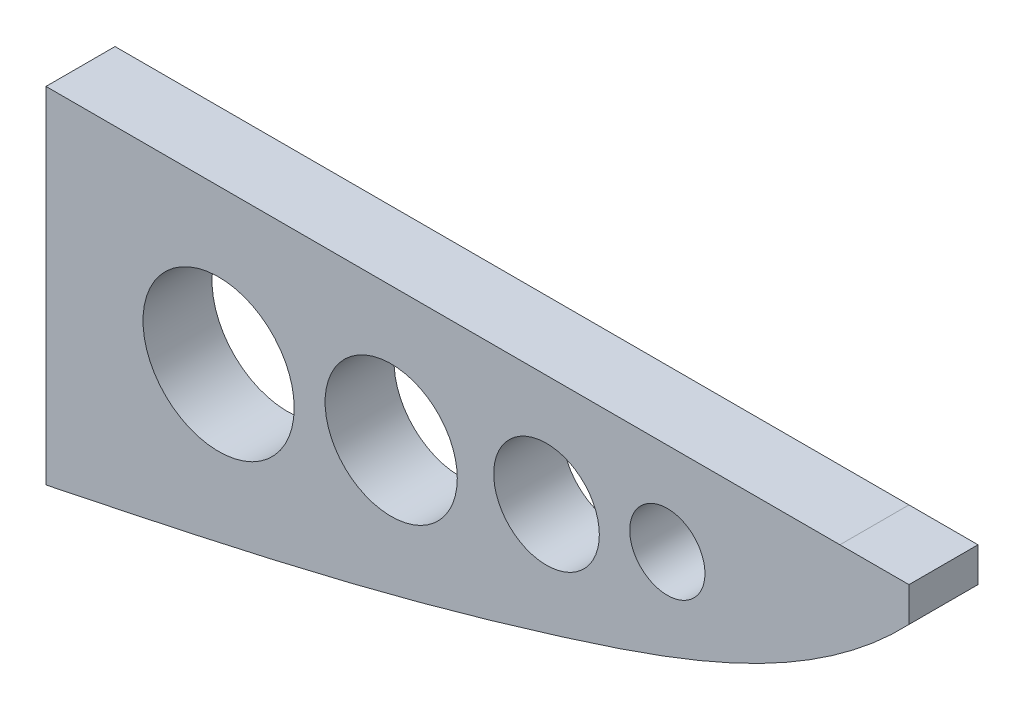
from build123d import *

# Parameters (mm, degrees)
AUFSATZ_LINEAR_AUSTRAGEN1_DEPTH = 20
SKIZZE3_R                       = 15.3
SKIZZE3_R_2                     = 10.9
SKIZZE3_R_3                     = 19.15
SKIZZE3_R_4                     = 21.9
SCHNITT_LINEAR_AUSTRAGEN1_DEPTH = 256.734237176


with BuildPart() as part:
    # Skizze1 → Aufsatz-Linear austragen1 (new body)
    with BuildSketch(Plane.XY):
        with BuildLine():
            Line((0, -50), (0, 50))
            Line((0, 50), (250, 50))
            Line((250, 50), (250, 40))
            add(Edge.make_bspline(
                [(0, -50), (33.41994869, -43.060858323), (83.963255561, -32.55419778), (169.944017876, -7.883209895), (222.615387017, 11.374413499), (250, 40)],
                knots=[0, 0, 0, 0, 0.381514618, 0.575066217, 1, 1, 1, 1], degree=3))
        make_face()
    extrude(amount=AUFSATZ_LINEAR_AUSTRAGEN1_DEPTH)

    # Skizze3 → Schnitt-Linear austragen1 (cut, through all)
    with BuildSketch(Plane.XY.offset(20)):
        with Locations((145, 17.660472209)):
            Circle(SKIZZE3_R)
        with Locations((180, 23.222585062)):
            Circle(SKIZZE3_R_2)
        with Locations((100, 11.25)):
            Circle(SKIZZE3_R_3)
        with Locations((50, 5.3)):
            Circle(SKIZZE3_R_4)
    extrude(amount=-SCHNITT_LINEAR_AUSTRAGEN1_DEPTH, mode=Mode.SUBTRACT)


solid = part.part
